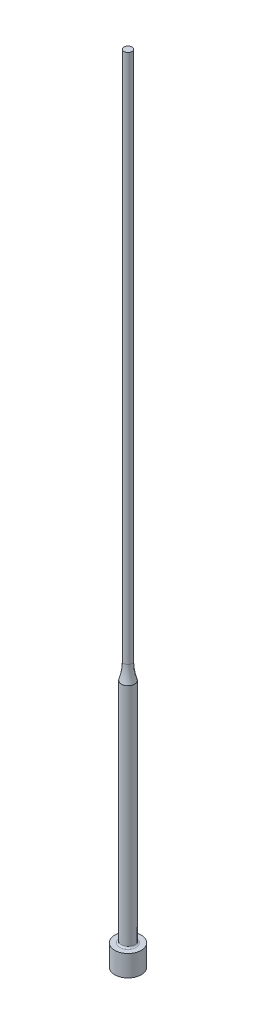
ISO-10303-21;
HEADER;
FILE_DESCRIPTION(('STEP AP214'),'2;1');
FILE_NAME('part.step','',(''),(''),'','','');
FILE_SCHEMA(('AUTOMOTIVE_DESIGN { 1 0 10303 214 1 1 1 1 }'));
ENDSEC;
DATA;
#1=APPLICATION_CONTEXT('core data for automotive mechanical design processes');
#2=APPLICATION_PROTOCOL_DEFINITION('international standard','automotive_design',2000,#1);
#3=PRODUCT_CONTEXT('',#1,'mechanical');
#4=PRODUCT('Part','Part','',(#3));
#5=PRODUCT_RELATED_PRODUCT_CATEGORY('part','',(#4));
#6=PRODUCT_DEFINITION_FORMATION('','',#4);
#7=PRODUCT_DEFINITION_CONTEXT('part definition',#1,'design');
#8=PRODUCT_DEFINITION('design','',#6,#7);
#9=PRODUCT_DEFINITION_SHAPE('','',#8);
#10=(LENGTH_UNIT() NAMED_UNIT(*) SI_UNIT(.MILLI.,.METRE.));
#11=(NAMED_UNIT(*) PLANE_ANGLE_UNIT() SI_UNIT($,.RADIAN.));
#12=(NAMED_UNIT(*) SI_UNIT($,.STERADIAN.) SOLID_ANGLE_UNIT());
#13=UNCERTAINTY_MEASURE_WITH_UNIT(LENGTH_MEASURE(1.E-05),#10,'distance_accuracy_value','');
#14=(GEOMETRIC_REPRESENTATION_CONTEXT(3) GLOBAL_UNCERTAINTY_ASSIGNED_CONTEXT((#13)) GLOBAL_UNIT_ASSIGNED_CONTEXT((#10,
#11,#12)) REPRESENTATION_CONTEXT('',''));
#15=CARTESIAN_POINT('',(0.,0.,0.));
#16=DIRECTION('',(0.,0.,1.));
#17=DIRECTION('',(1.,0.,0.));
#18=AXIS2_PLACEMENT_3D('',#15,#16,#17);
#19=CARTESIAN_POINT('',(0.750000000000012,150.,0.));
#20=DIRECTION('',(0.,-1.,0.));
#21=DIRECTION('',(1.,0.,0.));
#22=AXIS2_PLACEMENT_3D('',#19,#20,#21);
#23=PLANE('',#22);
#24=CARTESIAN_POINT('',(0.,150.,0.));
#25=DIRECTION('',(0.,1.,0.));
#26=DIRECTION('',(-1.,0.,0.));
#27=AXIS2_PLACEMENT_3D('',#24,#25,#26);
#28=CIRCLE('',#27,0.750000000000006);
#29=CARTESIAN_POINT('',(-0.75,150.,0.));
#30=VERTEX_POINT('',#29);
#31=EDGE_CURVE('E10',#30,#30,#28,.T.);
#32=ORIENTED_EDGE('',*,*,#31,.T.);
#33=EDGE_LOOP('',(#32));
#34=FACE_BOUND('',#33,.T.);
#35=ADVANCED_FACE('F30',(#34),#23,.F.);
#36=CARTESIAN_POINT('',(0.,150.,0.));
#37=DIRECTION('',(0.,1.,0.));
#38=DIRECTION('',(-1.,0.,0.));
#39=AXIS2_PLACEMENT_3D('',#36,#37,#38);
#40=CYLINDRICAL_SURFACE('',#39,0.750000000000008);
#41=ORIENTED_EDGE('',*,*,#31,.F.);
#42=EDGE_LOOP('',(#41));
#43=FACE_BOUND('',#42,.T.);
#44=CARTESIAN_POINT('',(0.,50.,0.));
#45=DIRECTION('',(0.,1.,0.));
#46=DIRECTION('',(-1.,0.,0.));
#47=AXIS2_PLACEMENT_3D('',#44,#45,#46);
#48=CIRCLE('',#47,0.750000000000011);
#49=CARTESIAN_POINT('',(-0.750000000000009,50.,0.));
#50=VERTEX_POINT('',#49);
#51=EDGE_CURVE('E36',#50,#50,#48,.T.);
#52=ORIENTED_EDGE('',*,*,#51,.T.);
#53=EDGE_LOOP('',(#52));
#54=FACE_BOUND('',#53,.T.);
#55=ADVANCED_FACE('F71',(#43,#54),#40,.T.);
#56=CARTESIAN_POINT('',(0.,50.,0.));
#57=DIRECTION('',(0.,1.,0.));
#58=DIRECTION('',(-1.,0.,0.));
#59=AXIS2_PLACEMENT_3D('',#56,#57,#58);
#60=TOROIDAL_SURFACE('',#59,10.75,10.);
#61=ORIENTED_EDGE('',*,*,#51,.F.);
#62=EDGE_LOOP('',(#61));
#63=FACE_BOUND('',#62,.T.);
#64=CARTESIAN_POINT('',(0.,46.8775010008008,0.));
#65=DIRECTION('',(0.,1.,0.));
#66=DIRECTION('',(-1.,0.,0.));
#67=AXIS2_PLACEMENT_3D('',#64,#65,#66);
#68=CIRCLE('',#67,1.25000000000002);
#69=CARTESIAN_POINT('',(-1.25000000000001,46.8775010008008,0.));
#70=VERTEX_POINT('',#69);
#71=EDGE_CURVE('E40',#70,#70,#68,.T.);
#72=ORIENTED_EDGE('',*,*,#71,.T.);
#73=EDGE_LOOP('',(#72));
#74=FACE_BOUND('',#73,.T.);
#75=ADVANCED_FACE('F75',(#63,#74),#60,.F.);
#76=CARTESIAN_POINT('',(0.,150.,0.));
#77=DIRECTION('',(0.,1.,0.));
#78=DIRECTION('',(-1.,0.,0.));
#79=AXIS2_PLACEMENT_3D('',#76,#77,#78);
#80=CYLINDRICAL_SURFACE('',#79,1.25000000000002);
#81=ORIENTED_EDGE('',*,*,#71,.F.);
#82=EDGE_LOOP('',(#81));
#83=FACE_BOUND('',#82,.T.);
#84=CARTESIAN_POINT('',(0.,4.3,0.));
#85=DIRECTION('',(0.,1.,0.));
#86=DIRECTION('',(-1.,0.,0.));
#87=AXIS2_PLACEMENT_3D('',#84,#85,#86);
#88=CIRCLE('',#87,1.25000000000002);
#89=CARTESIAN_POINT('',(-1.25000000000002,4.3,0.));
#90=VERTEX_POINT('',#89);
#91=EDGE_CURVE('E44',#90,#90,#88,.T.);
#92=ORIENTED_EDGE('',*,*,#91,.T.);
#93=EDGE_LOOP('',(#92));
#94=FACE_BOUND('',#93,.T.);
#95=ADVANCED_FACE('F80',(#83,#94),#80,.T.);
#96=CARTESIAN_POINT('',(0.,4.3,0.));
#97=DIRECTION('',(0.,1.,0.));
#98=DIRECTION('',(-1.,0.,0.));
#99=AXIS2_PLACEMENT_3D('',#96,#97,#98);
#100=TOROIDAL_SURFACE('',#99,1.55000000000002,0.3);
#101=ORIENTED_EDGE('',*,*,#91,.F.);
#102=EDGE_LOOP('',(#101));
#103=FACE_BOUND('',#102,.T.);
#104=CARTESIAN_POINT('',(0.,4.,0.));
#105=DIRECTION('',(0.,1.,0.));
#106=DIRECTION('',(-1.,0.,0.));
#107=AXIS2_PLACEMENT_3D('',#104,#105,#106);
#108=CIRCLE('',#107,1.55000000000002);
#109=CARTESIAN_POINT('',(-1.55000000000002,4.,0.));
#110=VERTEX_POINT('',#109);
#111=EDGE_CURVE('E49',#110,#110,#108,.T.);
#112=ORIENTED_EDGE('',*,*,#111,.T.);
#113=EDGE_LOOP('',(#112));
#114=FACE_BOUND('',#113,.T.);
#115=ADVANCED_FACE('F86',(#103,#114),#100,.F.);
#116=CARTESIAN_POINT('',(2.50000000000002,4.,0.));
#117=DIRECTION('',(0.,-1.,0.));
#118=DIRECTION('',(1.,0.,0.));
#119=AXIS2_PLACEMENT_3D('',#116,#117,#118);
#120=PLANE('',#119);
#121=ORIENTED_EDGE('',*,*,#111,.F.);
#122=EDGE_LOOP('',(#121));
#123=FACE_BOUND('',#122,.T.);
#124=CARTESIAN_POINT('',(0.,4.,0.));
#125=DIRECTION('',(0.,1.,0.));
#126=DIRECTION('',(-1.,0.,0.));
#127=AXIS2_PLACEMENT_3D('',#124,#125,#126);
#128=CIRCLE('',#127,2.50000000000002);
#129=CARTESIAN_POINT('',(-2.50000000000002,4.,0.));
#130=VERTEX_POINT('',#129);
#131=EDGE_CURVE('E52',#130,#130,#128,.T.);
#132=ORIENTED_EDGE('',*,*,#131,.T.);
#133=EDGE_LOOP('',(#132));
#134=FACE_BOUND('',#133,.T.);
#135=ADVANCED_FACE('F67',(#123,#134),#120,.F.);
#136=CARTESIAN_POINT('',(0.,150.,0.));
#137=DIRECTION('',(0.,1.,0.));
#138=DIRECTION('',(-1.,0.,0.));
#139=AXIS2_PLACEMENT_3D('',#136,#137,#138);
#140=CYLINDRICAL_SURFACE('',#139,2.50000000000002);
#141=ORIENTED_EDGE('',*,*,#131,.F.);
#142=EDGE_LOOP('',(#141));
#143=FACE_BOUND('',#142,.T.);
#144=CARTESIAN_POINT('',(0.,0.,0.));
#145=DIRECTION('',(0.,1.,0.));
#146=DIRECTION('',(-1.,0.,0.));
#147=AXIS2_PLACEMENT_3D('',#144,#145,#146);
#148=CIRCLE('',#147,2.50000000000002);
#149=CARTESIAN_POINT('',(-2.50000000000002,0.,0.));
#150=VERTEX_POINT('',#149);
#151=EDGE_CURVE('E55',#150,#150,#148,.T.);
#152=ORIENTED_EDGE('',*,*,#151,.T.);
#153=EDGE_LOOP('',(#152));
#154=FACE_BOUND('',#153,.T.);
#155=ADVANCED_FACE('F59',(#143,#154),#140,.T.);
#156=CARTESIAN_POINT('',(0.,0.,0.));
#157=DIRECTION('',(0.,1.,0.));
#158=DIRECTION('',(-1.,0.,0.));
#159=AXIS2_PLACEMENT_3D('',#156,#157,#158);
#160=PLANE('',#159);
#161=ORIENTED_EDGE('',*,*,#151,.F.);
#162=EDGE_LOOP('',(#161));
#163=FACE_BOUND('',#162,.T.);
#164=ADVANCED_FACE('F61',(#163),#160,.F.);
#165=CLOSED_SHELL('',(#35,#55,#75,#95,#115,#135,#155,#164));
#166=MANIFOLD_SOLID_BREP('B2',#165);
#167=ADVANCED_BREP_SHAPE_REPRESENTATION('',(#18,#166),#14);
#168=SHAPE_DEFINITION_REPRESENTATION(#9,#167);
ENDSEC;
END-ISO-10303-21;
